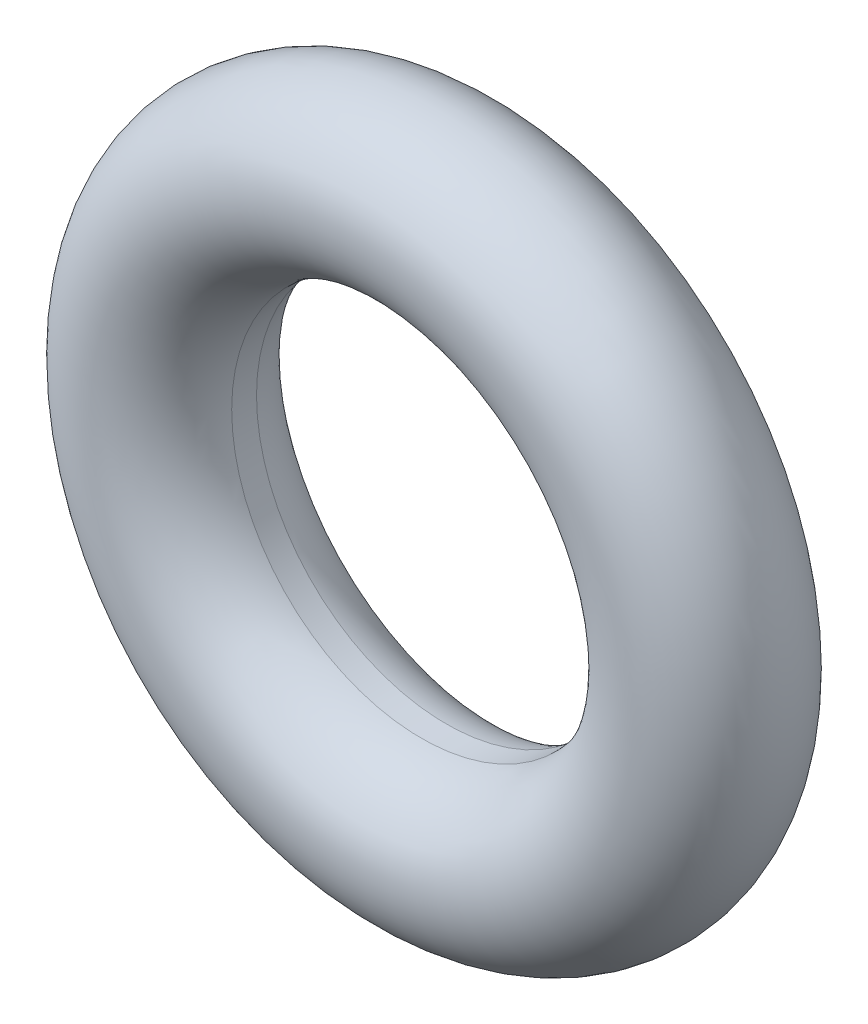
from build123d import *

# Parameters (mm, degrees)
SKETCH2_R               = 1.31
CUT_EXTRUDE1_DEPTH      = 9.069070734
CUT_EXTRUDE1_DEPTH_BACK = 9.069070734
SKETCH3_R               = 3.025


with BuildPart() as part:
    # Base-Sweep: sweep along a path in Sketch1
    with BuildLine(Plane.XY) as base_sweep_path:
        CenterArc((0, 0), 4.32, 0, 360)
    # Sketch2 → Base-Sweep (sweep)
    with BuildSketch(Plane(origin=(0, 0, 0), x_dir=(0, 0, -1), z_dir=(1, 0, 0))):
        with Locations((0, 4.32)):
            Circle(SKETCH2_R)
    sweep(path=base_sweep_path.line)

    # Sketch3 → Cut-Extrude1 (cut, two sides: drawn at the far end of the back side and taken through both)
    with BuildSketch(Plane.XY.offset(-CUT_EXTRUDE1_DEPTH_BACK)):
        with Locations(Location((0, 0, 0), (0, 0, 180))):
            Circle(SKETCH3_R)
    extrude(amount=CUT_EXTRUDE1_DEPTH + CUT_EXTRUDE1_DEPTH_BACK, mode=Mode.SUBTRACT)


solid = part.part
